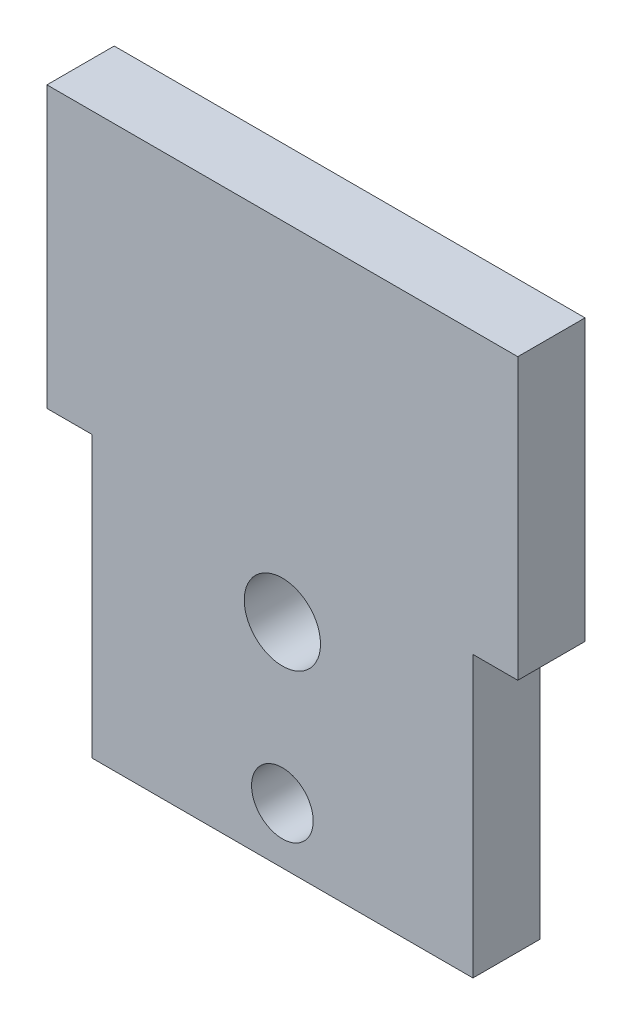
from build123d import *

# Parameters (mm, degrees)
SKETCH1_R           = 2.75
BOSS_EXTRUDE1_DEPTH = 6
M8_TAPPED_HOLE1_D   = 6.8


with BuildPart() as part:
    # Sketch1 → Boss-Extrude1 (new body)
    with BuildSketch(Plane.XY):
        Polygon((0, 0), (0, 25), (-4, 25), (-4, 50), (38, 50), (38, 25), (34, 25), (34, 0), align=None)
        with Locations((17, 5)):
            Circle(SKETCH1_R, mode=Mode.SUBTRACT)
    extrude(amount=BOSS_EXTRUDE1_DEPTH)

    # M8 Tapped Hole1 (through all)
    with Locations(Plane(origin=(17, 19, 6), x_dir=(1, 0, 0), z_dir=(0, 0, 1))):
        with Locations((0, 0)):
            Hole(M8_TAPPED_HOLE1_D / 2)


solid = part.part
